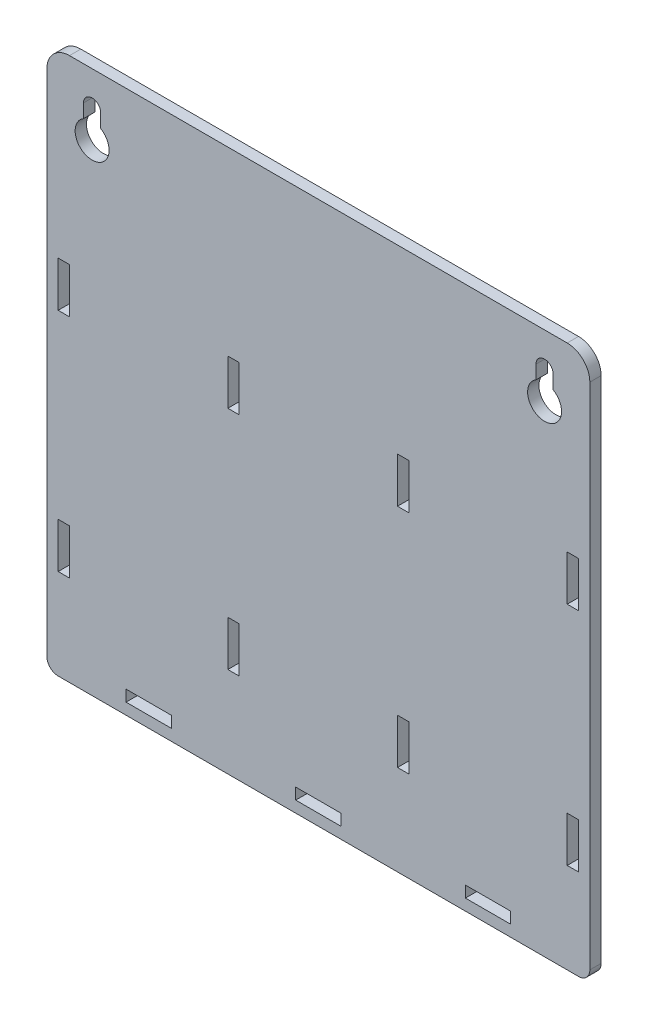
from build123d import *

# Parameters (mm, degrees)
BOSS_EXTRUDE1_DEPTH = 3.175
CUT_EXTRUDE1_DEPTH  = 171.417958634
SKETCH3_W           = 3.175
SKETCH3_H           = 12.7
CUT_EXTRUDE2_DEPTH  = 171.417958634
SKETCH4_W           = 12.7
SKETCH4_H           = 3.175
CUT_EXTRUDE3_DEPTH  = 171.417958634
FILLET1_R           = 3.175


with BuildPart() as part:
    # Sketch1 → Boss-Extrude1 (new body)
    with BuildSketch(Plane.XY):
        with BuildLine():
            Line((-76.2, 0), (76.2, 0))
            Line((76.2, 0), (76.2, 146.05))
            ThreePointArc((76.2, 146.05), (74.340128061, 150.540128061), (69.85, 152.4))
            Line((69.85, 152.4), (-69.85, 152.4))
            ThreePointArc((-69.85, 152.4), (-74.340128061, 150.540128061), (-76.2, 146.05))
            Line((-76.2, 146.05), (-76.2, 0))
        make_face()
    extrude(amount=-BOSS_EXTRUDE1_DEPTH)

    # Sketch2 → Cut-Extrude1 (cut, through all)
    with BuildSketch(Plane.XY):
        with BuildLine():
            Line((-65.913, 142.875), (-65.913, 139.043451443))
            ThreePointArc((-65.913, 139.043451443), (-63.5, 130.175), (-61.087, 139.043451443))
            Line((-61.087, 139.043451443), (-61.087, 142.875))
            ThreePointArc((-61.087, 142.875), (-63.5, 145.288), (-65.913, 142.875))
        make_face()
    cut_extrude1 = extrude(amount=-CUT_EXTRUDE1_DEPTH, mode=Mode.SUBTRACT)

    # Sketch3 → Cut-Extrude2 (cut, through all)
    with BuildSketch(Plane.XY):
        with Locations((-23.8125, 95.25)):
            Rectangle(SKETCH3_W, SKETCH3_H)
        with Locations((-23.8125, 31.75)):
            Rectangle(SKETCH3_W, SKETCH3_H)
        with Locations((-71.4375, 95.25)):
            Rectangle(SKETCH3_W, SKETCH3_H)
        with Locations((-71.4375, 31.75)):
            Rectangle(SKETCH3_W, SKETCH3_H)
    cut_extrude2 = extrude(amount=-CUT_EXTRUDE2_DEPTH, mode=Mode.SUBTRACT)

    # Mirror1: Cut-Extrude1, Cut-Extrude2 across plane
    add(cut_extrude1.mirror(Plane(origin=(0, 0, 0), x_dir=(0, 0, 1), z_dir=(1, 0, 0))), mode=Mode.SUBTRACT)
    add(cut_extrude2.mirror(Plane(origin=(0, 0, 0), x_dir=(0, 0, 1), z_dir=(1, 0, 0))), mode=Mode.SUBTRACT)

    # Sketch4 → Cut-Extrude3 (cut, through all)
    with BuildSketch(Plane.XY):
        with Locations((-47.625, 4.7625)):
            Rectangle(SKETCH4_W, SKETCH4_H)
        with Locations((0, 4.7625)):
            Rectangle(SKETCH4_W, SKETCH4_H)
        with Locations((47.625, 4.7625)):
            Rectangle(SKETCH4_W, SKETCH4_H)
    extrude(amount=-CUT_EXTRUDE3_DEPTH, mode=Mode.SUBTRACT)

    # Fillet1
    fillet1_edges = [part.edges().sort_by_distance(p)[0] for p in [
        (76.2, 0, -1.5875),
        (-76.2, 0, -1.5875),
    ]]
    fillet(fillet1_edges, radius=FILLET1_R)


solid = part.part
